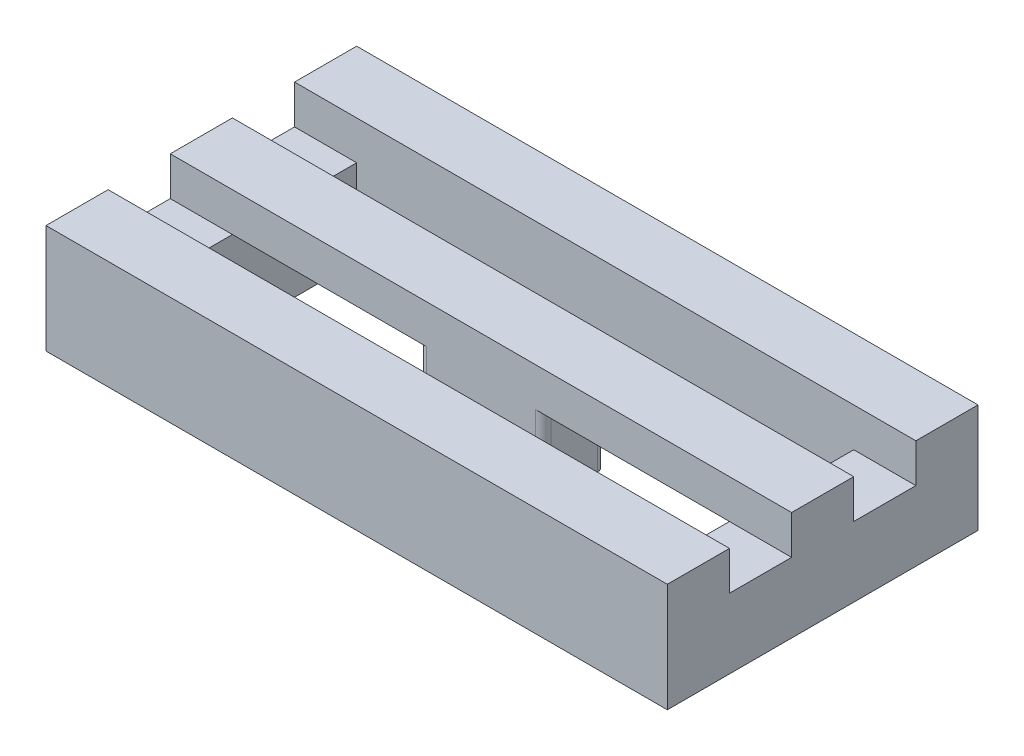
from build123d import *

# Parameters (mm, degrees)
SKIZZE1_W                       = 16
SKIZZE1_H                       = 8
LINEAR_AUSTRAGEN1_DEPTH         = 3.2
SKIZZE2_W                       = 16
SKIZZE2_H                       = 1.6
SCHNITT_LINEAR_AUSTRAGEN2_DEPTH = 1
SKIZZE4_W                       = 12.8
SKIZZE4_H                       = 4.8
SCHNITT_LINEAR_AUSTRAGEN3_DEPTH = 2.2
SKIZZE5_W                       = 3.2
SKIZZE5_H                       = 1.6
LINEAR_AUSTRAGEN2_DEPTH         = 2
VERRUNDUNG1_R                   = 0.2
SKIZZE6_W                       = 16
SKIZZE6_H                       = 8
SKIZZE6_W_2                     = 15.2
SKIZZE6_H_2                     = 7.2
SCHNITT_LINEAR_AUSTRAGEN4_DEPTH = 0.4


with BuildPart() as part:
    # Skizze1 → Linear austragen1 (new body)
    with BuildSketch(Plane(origin=(0, 0, 0), x_dir=(1, 0, 0), z_dir=(0, 1, 0))):
        with Locations((8, 4)):
            Rectangle(SKIZZE1_W, SKIZZE1_H)
    extrude(amount=LINEAR_AUSTRAGEN1_DEPTH)

    # Skizze2 → Schnitt-Linear austragen2 (cut)
    with BuildSketch(Plane(origin=(0, 3.2, 0), x_dir=(-1, 0, 0), z_dir=(0, 1, 0))):
        with Locations((-8, -5.6)):
            Rectangle(SKIZZE2_W, SKIZZE2_H)
        with Locations((-8, -2.4)):
            Rectangle(SKIZZE2_W, SKIZZE2_H)
    extrude(amount=-SCHNITT_LINEAR_AUSTRAGEN2_DEPTH, mode=Mode.SUBTRACT)

    # Skizze4 → Schnitt-Linear austragen3 (cut)
    with BuildSketch(Plane.XZ):
        with Locations((8, -4)):
            Rectangle(SKIZZE4_W, SKIZZE4_H)
    extrude(amount=-SCHNITT_LINEAR_AUSTRAGEN3_DEPTH, mode=Mode.SUBTRACT)

    # Skizze5 → Linear austragen2 (add)
    with BuildSketch(Plane.XZ.offset(-2.2)):
        with Locations((8, -4)):
            Rectangle(SKIZZE5_W, SKIZZE5_H)
    extrude(amount=LINEAR_AUSTRAGEN2_DEPTH)

    # Verrundung1
    verrundung1_edges = [part.edges().sort_by_distance(p)[0] for p in [
        (6.4, 1.2, -3.2),
        (6.4, 1.2, -4.8),
        (9.6, 1.2, -4.8),
        (9.6, 1.2, -3.2),
    ]]
    fillet(verrundung1_edges, radius=VERRUNDUNG1_R)

    # Skizze6 → Schnitt-Linear austragen4 (cut)
    with BuildSketch(Plane.XZ):
        with Locations((8, -4)):
            Rectangle(SKIZZE6_W, SKIZZE6_H)
        with Locations((8, -4)):
            Rectangle(SKIZZE6_W_2, SKIZZE6_H_2, mode=Mode.SUBTRACT)
    extrude(amount=-SCHNITT_LINEAR_AUSTRAGEN4_DEPTH, mode=Mode.SUBTRACT)


solid = part.part
